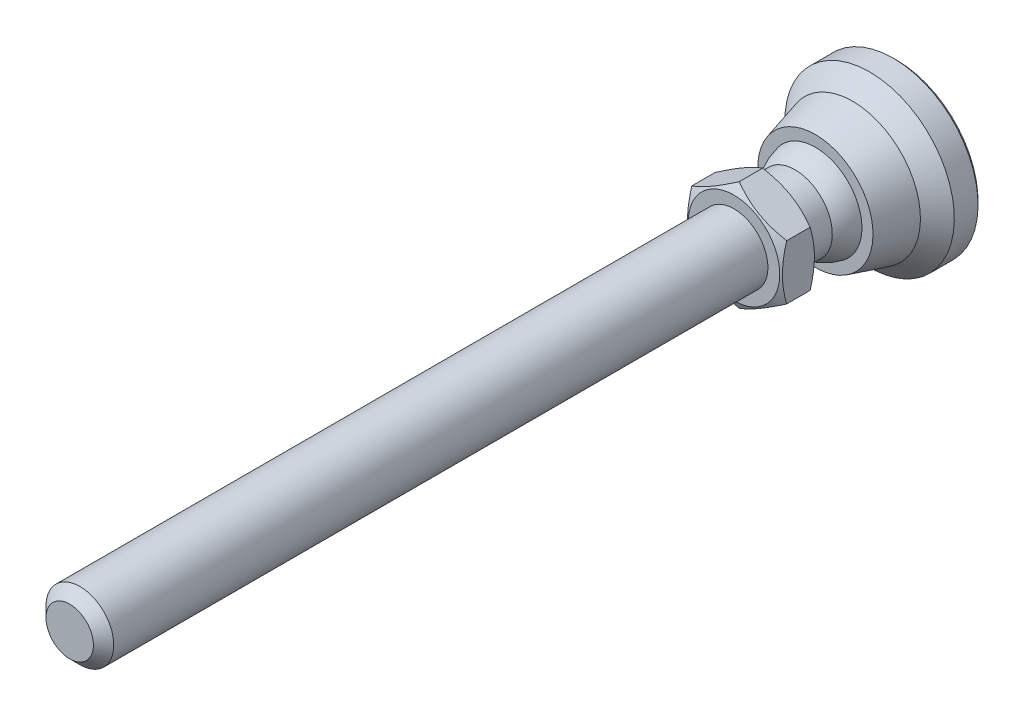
ISO-10303-21;
HEADER;
FILE_DESCRIPTION(('STEP AP214'),'2;1');
FILE_NAME('part.step','',(''),(''),'','','');
FILE_SCHEMA(('AUTOMOTIVE_DESIGN { 1 0 10303 214 1 1 1 1 }'));
ENDSEC;
DATA;
#1=APPLICATION_CONTEXT('core data for automotive mechanical design processes');
#2=APPLICATION_PROTOCOL_DEFINITION('international standard','automotive_design',2000,#1);
#3=PRODUCT_CONTEXT('',#1,'mechanical');
#4=PRODUCT('Part','Part','',(#3));
#5=PRODUCT_RELATED_PRODUCT_CATEGORY('part','',(#4));
#6=PRODUCT_DEFINITION_FORMATION('','',#4);
#7=PRODUCT_DEFINITION_CONTEXT('part definition',#1,'design');
#8=PRODUCT_DEFINITION('design','',#6,#7);
#9=PRODUCT_DEFINITION_SHAPE('','',#8);
#10=(LENGTH_UNIT() NAMED_UNIT(*) SI_UNIT(.MILLI.,.METRE.));
#11=(NAMED_UNIT(*) PLANE_ANGLE_UNIT() SI_UNIT($,.RADIAN.));
#12=(NAMED_UNIT(*) SI_UNIT($,.STERADIAN.) SOLID_ANGLE_UNIT());
#13=UNCERTAINTY_MEASURE_WITH_UNIT(LENGTH_MEASURE(1.E-05),#10,'distance_accuracy_value','');
#14=(GEOMETRIC_REPRESENTATION_CONTEXT(3) GLOBAL_UNCERTAINTY_ASSIGNED_CONTEXT((#13)) GLOBAL_UNIT_ASSIGNED_CONTEXT((#10,
#11,#12)) REPRESENTATION_CONTEXT('',''));
#15=CARTESIAN_POINT('',(0.,0.,0.));
#16=DIRECTION('',(0.,0.,1.));
#17=DIRECTION('',(1.,0.,0.));
#18=AXIS2_PLACEMENT_3D('',#15,#16,#17);
#19=CARTESIAN_POINT('',(-5.49999999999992,0.,19.));
#20=DIRECTION('',(0.,0.,1.));
#21=DIRECTION('',(0.,-1.,0.));
#22=AXIS2_PLACEMENT_3D('',#19,#20,#21);
#23=PLANE('',#22);
#24=CARTESIAN_POINT('',(0.,0.,19.));
#25=DIRECTION('',(0.,0.,-1.));
#26=DIRECTION('',(0.,1.,0.));
#27=AXIS2_PLACEMENT_3D('',#24,#25,#26);
#28=CIRCLE('',#27,5.49999999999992);
#29=CARTESIAN_POINT('',(0.,5.49999999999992,19.));
#30=VERTEX_POINT('',#29);
#31=EDGE_CURVE('E115',#30,#30,#28,.T.);
#32=ORIENTED_EDGE('',*,*,#31,.F.);
#33=EDGE_LOOP('',(#32));
#34=FACE_BOUND('',#33,.T.);
#35=CARTESIAN_POINT('',(0.,0.,19.));
#36=DIRECTION('',(0.,0.,-1.));
#37=DIRECTION('',(0.,1.,0.));
#38=AXIS2_PLACEMENT_3D('',#35,#36,#37);
#39=CIRCLE('',#38,6.75);
#40=CARTESIAN_POINT('',(0.,6.75,19.));
#41=VERTEX_POINT('',#40);
#42=EDGE_CURVE('E73',#41,#41,#39,.T.);
#43=ORIENTED_EDGE('',*,*,#42,.T.);
#44=EDGE_LOOP('',(#43));
#45=FACE_BOUND('',#44,.T.);
#46=ADVANCED_FACE('F14',(#34,#45),#23,.F.);
#47=CARTESIAN_POINT('',(0.,0.,0.));
#48=DIRECTION('',(0.,0.,-1.));
#49=DIRECTION('',(0.,1.,0.));
#50=AXIS2_PLACEMENT_3D('',#47,#48,#49);
#51=CYLINDRICAL_SURFACE('',#50,5.49999999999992);
#52=CARTESIAN_POINT('',(0.,0.,15.));
#53=DIRECTION('',(0.,0.,-1.));
#54=DIRECTION('',(0.,1.,0.));
#55=AXIS2_PLACEMENT_3D('',#52,#53,#54);
#56=CIRCLE('',#55,5.49999999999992);
#57=CARTESIAN_POINT('',(-5.49999999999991,0.,15.));
#58=VERTEX_POINT('',#57);
#59=EDGE_CURVE('E112',#58,#58,#56,.T.);
#60=ORIENTED_EDGE('',*,*,#59,.F.);
#61=EDGE_LOOP('',(#60));
#62=FACE_BOUND('',#61,.T.);
#63=ORIENTED_EDGE('',*,*,#31,.T.);
#64=EDGE_LOOP('',(#63));
#65=FACE_BOUND('',#64,.T.);
#66=ADVANCED_FACE('F139',(#62,#65),#51,.T.);
#67=CARTESIAN_POINT('',(0.,0.,10.6698729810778));
#68=DIRECTION('',(0.,0.,-1.));
#69=DIRECTION('',(-1.,0.,0.));
#70=AXIS2_PLACEMENT_3D('',#67,#68,#69);
#71=SPHERICAL_SURFACE('',#70,7.);
#72=CARTESIAN_POINT('',(0.,0.,12.));
#73=DIRECTION('',(0.,0.,-1.));
#74=DIRECTION('',(0.,1.,0.));
#75=AXIS2_PLACEMENT_3D('',#72,#73,#74);
#76=CIRCLE('',#75,6.87246404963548);
#77=CARTESIAN_POINT('',(-6.87246404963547,0.,12.));
#78=VERTEX_POINT('',#77);
#79=EDGE_CURVE('E109',#78,#78,#76,.T.);
#80=CARTESIAN_POINT('',(-6.87246404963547,0.,12.));
#81=CARTESIAN_POINT('',(-6.8658721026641,0.,12.0340591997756));
#82=CARTESIAN_POINT('',(-6.85902692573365,0.,12.0680693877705));
#83=CARTESIAN_POINT('',(-6.84483171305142,0.,12.1359842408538));
#84=CARTESIAN_POINT('',(-6.83748167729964,0.,12.1698889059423));
#85=CARTESIAN_POINT('',(-6.82227834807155,0.,12.2375852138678));
#86=CARTESIAN_POINT('',(-6.81442505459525,0.,12.2713768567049));
#87=CARTESIAN_POINT('',(-6.79821695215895,0.,12.3388396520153));
#88=CARTESIAN_POINT('',(-6.78986214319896,0.,12.3725108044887));
#89=CARTESIAN_POINT('',(-6.7726528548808,0.,12.4397251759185));
#90=CARTESIAN_POINT('',(-6.76379837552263,0.,12.473268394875));
#91=CARTESIAN_POINT('',(-6.74559170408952,0.,12.5402194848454));
#92=CARTESIAN_POINT('',(-6.73623951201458,0.,12.5736273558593));
#93=CARTESIAN_POINT('',(-6.71703948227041,0.,12.6403003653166));
#94=CARTESIAN_POINT('',(-6.70719164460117,0.,12.67356550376));
#95=CARTESIAN_POINT('',(-6.68700250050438,0.,12.7399456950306));
#96=CARTESIAN_POINT('',(-6.67666119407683,0.,12.7730607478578));
#97=CARTESIAN_POINT('',(-6.65548739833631,0.,12.8391334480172));
#98=CARTESIAN_POINT('',(-6.64465490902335,0.,12.8720910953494));
#99=CARTESIAN_POINT('',(-6.6225011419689,0.,12.9378416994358));
#100=CARTESIAN_POINT('',(-6.61117986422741,0.,12.9706346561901));
#101=CARTESIAN_POINT('',(-6.5880510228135,0.,13.0360486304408));
#102=CARTESIAN_POINT('',(-6.57624345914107,0.,13.0686696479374));
#103=CARTESIAN_POINT('',(-6.55214465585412,0.,13.1337325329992));
#104=CARTESIAN_POINT('',(-6.5398534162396,0.,13.1661744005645));
#105=CARTESIAN_POINT('',(-6.51478997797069,0.,13.2308718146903));
#106=CARTESIAN_POINT('',(-6.5020177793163,0.,13.2631273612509));
#107=CARTESIAN_POINT('',(-6.47599524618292,0.,13.3274450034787));
#108=CARTESIAN_POINT('',(-6.46274491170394,0.,13.3595070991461));
#109=CARTESIAN_POINT('',(-6.4357690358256,0.,13.4234307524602));
#110=CARTESIAN_POINT('',(-6.42204349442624,0.,13.455292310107));
#111=CARTESIAN_POINT('',(-6.39412023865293,0.,13.5188078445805));
#112=CARTESIAN_POINT('',(-6.37992252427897,0.,13.5504618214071));
#113=CARTESIAN_POINT('',(-6.35105806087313,0.,13.6135551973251));
#114=CARTESIAN_POINT('',(-6.33639131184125,0.,13.6449945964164));
#115=CARTESIAN_POINT('',(-6.30659202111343,0.,13.7076518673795));
#116=CARTESIAN_POINT('',(-6.29145947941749,0.,13.7388697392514));
#117=CARTESIAN_POINT('',(-6.26073194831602,0.,13.8010770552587));
#118=CARTESIAN_POINT('',(-6.24513695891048,0.,13.8320664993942));
#119=CARTESIAN_POINT('',(-6.21348797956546,0.,13.8938101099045));
#120=CARTESIAN_POINT('',(-6.19743398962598,0.,13.9245642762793));
#121=CARTESIAN_POINT('',(-6.16487055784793,0.,13.9858305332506));
#122=CARTESIAN_POINT('',(-6.14836111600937,0.,14.016342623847));
#123=CARTESIAN_POINT('',(-6.11489042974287,0.,14.0771179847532));
#124=CARTESIAN_POINT('',(-6.09792918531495,0.,14.107381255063));
#125=CARTESIAN_POINT('',(-6.06355864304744,0.,14.1676522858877));
#126=CARTESIAN_POINT('',(-6.04614934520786,0.,14.1976600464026));
#127=CARTESIAN_POINT('',(-6.01088654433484,0.,14.2574134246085));
#128=CARTESIAN_POINT('',(-5.99303304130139,0.,14.2871590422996));
#129=CARTESIAN_POINT('',(-5.9568857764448,0.,14.3463815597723));
#130=CARTESIAN_POINT('',(-5.93859201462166,0.,14.3758584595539));
#131=CARTESIAN_POINT('',(-5.90156827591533,0.,14.4345370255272));
#132=CARTESIAN_POINT('',(-5.88283829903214,0.,14.4637386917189));
#133=CARTESIAN_POINT('',(-5.84494627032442,0.,14.5218603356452));
#134=CARTESIAN_POINT('',(-5.82578421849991,0.,14.5507803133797));
#135=CARTESIAN_POINT('',(-5.78703227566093,0.,14.6083321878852));
#136=CARTESIAN_POINT('',(-5.76744238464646,0.,14.6369640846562));
#137=CARTESIAN_POINT('',(-5.72783909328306,0.,14.6939334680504));
#138=CARTESIAN_POINT('',(-5.70782569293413,0.,14.7222709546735));
#139=CARTESIAN_POINT('',(-5.66737980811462,0.,14.778645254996));
#140=CARTESIAN_POINT('',(-5.64694732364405,0.,14.8066820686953));
#141=CARTESIAN_POINT('',(-5.60566778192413,0.,14.862448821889));
#142=CARTESIAN_POINT('',(-5.58482072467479,0.,14.8901787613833));
#143=CARTESIAN_POINT('',(-5.54271666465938,0.,14.9453256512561));
#144=CARTESIAN_POINT('',(-5.52145966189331,0.,14.9727426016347));
#145=CARTESIAN_POINT('',(-5.49999999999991,0.,15.));
#146=B_SPLINE_CURVE_WITH_KNOTS('',3,(#80,#81,#82,#83,#84,#85,#86,#87,#88,#89,#90,#91,#92,#93,
#94,#95,#96,#97,#98,#99,#100,#101,#102,#103,#104,#105,#106,#107,#108,#109,#110,#111,#112,#113,
#114,#115,#116,#117,#118,#119,#120,#121,#122,#123,#124,#125,#126,#127,#128,#129,#130,#131,#132,
#133,#134,#135,#136,#137,#138,#139,#140,#141,#142,#143,#144,#145),.UNSPECIFIED.,.F.,.F.,(4,2,2,
2,2,2,2,2,2,2,2,2,2,2,2,2,2,2,2,2,2,2,2,2,2,2,2,2,2,2,2,2,4),(0.,0.104072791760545,
0.208145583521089,0.312218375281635,0.416291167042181,0.520363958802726,0.62443675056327,
0.728509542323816,0.83258233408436,0.936655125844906,1.04072791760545,1.144800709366,
1.24887350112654,1.35294629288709,1.45701908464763,1.56109187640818,1.66516466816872,
1.76923745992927,1.87331025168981,1.97738304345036,2.0814558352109,2.18552862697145,
2.28960141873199,2.39367421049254,2.49774700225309,2.60181979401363,2.70589258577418,
2.80996537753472,2.91403816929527,3.01811096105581,3.12218375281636,3.2262565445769,
3.33032933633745),.UNSPECIFIED.);
#147=EDGE_CURVE('BSEAM146',#78,#58,#146,.T.);
#148=ORIENTED_EDGE('',*,*,#79,.F.);
#149=ORIENTED_EDGE('',*,*,#59,.T.);
#150=ORIENTED_EDGE('',*,*,#147,.T.);
#151=ORIENTED_EDGE('',*,*,#147,.F.);
#152=EDGE_LOOP('',(#148,#150,#149,#151));
#153=FACE_BOUND('',#152,.T.);
#154=ADVANCED_FACE('F146',(#153),#71,.T.);
#155=CARTESIAN_POINT('',(-8.5,0.,12.));
#156=DIRECTION('',(0.,0.,-1.));
#157=DIRECTION('',(0.,1.,0.));
#158=AXIS2_PLACEMENT_3D('',#155,#156,#157);
#159=PLANE('',#158);
#160=CARTESIAN_POINT('',(0.,0.,12.));
#161=DIRECTION('',(0.,0.,-1.));
#162=DIRECTION('',(0.,1.,0.));
#163=AXIS2_PLACEMENT_3D('',#160,#161,#162);
#164=CIRCLE('',#163,8.5);
#165=CARTESIAN_POINT('',(0.,8.5,12.));
#166=VERTEX_POINT('',#165);
#167=EDGE_CURVE('E106',#166,#166,#164,.T.);
#168=ORIENTED_EDGE('',*,*,#167,.F.);
#169=EDGE_LOOP('',(#168));
#170=FACE_BOUND('',#169,.T.);
#171=ORIENTED_EDGE('',*,*,#79,.T.);
#172=EDGE_LOOP('',(#171));
#173=FACE_BOUND('',#172,.T.);
#174=ADVANCED_FACE('F250',(#170,#173),#159,.F.);
#175=CARTESIAN_POINT('',(0.,0.,12.));
#176=DIRECTION('',(0.,0.,-1.));
#177=DIRECTION('',(0.,1.,0.));
#178=AXIS2_PLACEMENT_3D('',#175,#176,#177);
#179=CONICAL_SURFACE('',#178,8.5,0.266252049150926);
#180=CARTESIAN_POINT('',(0.,0.,6.5));
#181=DIRECTION('',(0.,0.,-1.));
#182=DIRECTION('',(0.,1.,0.));
#183=AXIS2_PLACEMENT_3D('',#180,#181,#182);
#184=CIRCLE('',#183,10.);
#185=CARTESIAN_POINT('',(0.,10.,6.5));
#186=VERTEX_POINT('',#185);
#187=EDGE_CURVE('E103',#186,#186,#184,.T.);
#188=ORIENTED_EDGE('',*,*,#187,.F.);
#189=EDGE_LOOP('',(#188));
#190=FACE_BOUND('',#189,.T.);
#191=ORIENTED_EDGE('',*,*,#167,.T.);
#192=EDGE_LOOP('',(#191));
#193=FACE_BOUND('',#192,.T.);
#194=ADVANCED_FACE('F246',(#190,#193),#179,.T.);
#195=CARTESIAN_POINT('',(0.,0.,6.5));
#196=DIRECTION('',(0.,0.,-1.));
#197=DIRECTION('',(0.,1.,0.));
#198=AXIS2_PLACEMENT_3D('',#195,#196,#197);
#199=CONICAL_SURFACE('',#198,10.,0.785398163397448);
#200=CARTESIAN_POINT('',(0.,0.,4.));
#201=DIRECTION('',(0.,0.,-1.));
#202=DIRECTION('',(0.,1.,0.));
#203=AXIS2_PLACEMENT_3D('',#200,#201,#202);
#204=CIRCLE('',#203,12.5);
#205=CARTESIAN_POINT('',(0.,12.5,4.));
#206=VERTEX_POINT('',#205);
#207=EDGE_CURVE('E100',#206,#206,#204,.T.);
#208=ORIENTED_EDGE('',*,*,#207,.F.);
#209=EDGE_LOOP('',(#208));
#210=FACE_BOUND('',#209,.T.);
#211=ORIENTED_EDGE('',*,*,#187,.T.);
#212=EDGE_LOOP('',(#211));
#213=FACE_BOUND('',#212,.T.);
#214=ADVANCED_FACE('F242',(#210,#213),#199,.T.);
#215=CARTESIAN_POINT('',(0.,0.,0.));
#216=DIRECTION('',(0.,0.,-1.));
#217=DIRECTION('',(0.,1.,0.));
#218=AXIS2_PLACEMENT_3D('',#215,#216,#217);
#219=CYLINDRICAL_SURFACE('',#218,12.5);
#220=CARTESIAN_POINT('',(0.,0.,0.499999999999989));
#221=DIRECTION('',(0.,0.,-1.));
#222=DIRECTION('',(0.,1.,0.));
#223=AXIS2_PLACEMENT_3D('',#220,#221,#222);
#224=CIRCLE('',#223,12.5);
#225=CARTESIAN_POINT('',(0.,12.5,0.499999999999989));
#226=VERTEX_POINT('',#225);
#227=EDGE_CURVE('E97',#226,#226,#224,.T.);
#228=ORIENTED_EDGE('',*,*,#227,.F.);
#229=EDGE_LOOP('',(#228));
#230=FACE_BOUND('',#229,.T.);
#231=ORIENTED_EDGE('',*,*,#207,.T.);
#232=EDGE_LOOP('',(#231));
#233=FACE_BOUND('',#232,.T.);
#234=ADVANCED_FACE('F238',(#230,#233),#219,.T.);
#235=CARTESIAN_POINT('',(0.,0.,0.499999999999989));
#236=DIRECTION('',(0.,0.,1.));
#237=DIRECTION('',(0.,-1.,0.));
#238=AXIS2_PLACEMENT_3D('',#235,#236,#237);
#239=CONICAL_SURFACE('',#238,12.5,0.785398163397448);
#240=CARTESIAN_POINT('',(0.,0.,0.));
#241=DIRECTION('',(0.,0.,-1.));
#242=DIRECTION('',(0.,1.,0.));
#243=AXIS2_PLACEMENT_3D('',#240,#241,#242);
#244=CIRCLE('',#243,12.);
#245=CARTESIAN_POINT('',(0.,12.,0.));
#246=VERTEX_POINT('',#245);
#247=EDGE_CURVE('E94',#246,#246,#244,.T.);
#248=ORIENTED_EDGE('',*,*,#247,.F.);
#249=EDGE_LOOP('',(#248));
#250=FACE_BOUND('',#249,.T.);
#251=ORIENTED_EDGE('',*,*,#227,.T.);
#252=EDGE_LOOP('',(#251));
#253=FACE_BOUND('',#252,.T.);
#254=ADVANCED_FACE('F234',(#250,#253),#239,.T.);
#255=CARTESIAN_POINT('',(-12.,0.,0.));
#256=DIRECTION('',(0.,0.,1.));
#257=DIRECTION('',(0.,-1.,0.));
#258=AXIS2_PLACEMENT_3D('',#255,#256,#257);
#259=PLANE('',#258);
#260=ORIENTED_EDGE('',*,*,#247,.T.);
#261=EDGE_LOOP('',(#260));
#262=FACE_BOUND('',#261,.T.);
#263=ADVANCED_FACE('F136',(#262),#259,.F.);
#264=CARTESIAN_POINT('',(0.,0.,19.));
#265=DIRECTION('',(0.,0.,1.));
#266=DIRECTION('',(0.,-1.,0.));
#267=AXIS2_PLACEMENT_3D('',#264,#265,#266);
#268=CONICAL_SURFACE('',#267,6.75,1.0471975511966);
#269=CARTESIAN_POINT('',(-7.,10.8183826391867,22.5423615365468));
#270=CARTESIAN_POINT('',(-7.,10.5129575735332,22.3943539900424));
#271=CARTESIAN_POINT('',(-7.,10.2068273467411,22.2477764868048));
#272=CARTESIAN_POINT('',(-7.,9.59278140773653,21.9582866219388));
#273=CARTESIAN_POINT('',(-7.,9.28486541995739,21.8153748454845));
#274=CARTESIAN_POINT('',(-7.,8.66526829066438,21.5332944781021));
#275=CARTESIAN_POINT('',(-7.,8.35357575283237,21.3941508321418));
#276=CARTESIAN_POINT('',(-7.,7.72769846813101,21.1216080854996));
#277=CARTESIAN_POINT('',(-7.,7.41351384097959,20.988208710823));
#278=CARTESIAN_POINT('',(-7.,6.77215896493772,20.7245643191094));
#279=CARTESIAN_POINT('',(-7.,6.44489230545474,20.5945525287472));
#280=CARTESIAN_POINT('',(-7.,5.78651717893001,20.3444596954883));
#281=CARTESIAN_POINT('',(-7.,5.45540828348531,20.2243797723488));
#282=CARTESIAN_POINT('',(-7.,4.78944983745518,19.9973308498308));
#283=CARTESIAN_POINT('',(-7.,4.45460954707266,19.8903349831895));
#284=CARTESIAN_POINT('',(-7.,3.78013830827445,19.6929106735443));
#285=CARTESIAN_POINT('',(-7.,3.44050891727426,19.6024769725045));
#286=CARTESIAN_POINT('',(-7.,2.75808654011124,19.4430262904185));
#287=CARTESIAN_POINT('',(-7.,2.41532108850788,19.3738946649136));
#288=CARTESIAN_POINT('',(-7.,1.89808177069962,19.2891856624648));
#289=CARTESIAN_POINT('',(-7.,1.72514049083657,19.264112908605));
#290=CARTESIAN_POINT('',(-7.,1.3784111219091,19.2207895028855));
#291=CARTESIAN_POINT('',(-7.,1.20462311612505,19.202538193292));
#292=CARTESIAN_POINT('',(-7.,0.858686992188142,19.1734482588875));
#293=CARTESIAN_POINT('',(-7.,0.686546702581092,19.1625168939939));
#294=CARTESIAN_POINT('',(-7.,0.34195829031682,19.1479408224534));
#295=CARTESIAN_POINT('',(-7.,0.169510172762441,19.1442959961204));
#296=CARTESIAN_POINT('',(-7.,-0.175386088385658,19.1443798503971));
#297=CARTESIAN_POINT('',(-7.,-0.347834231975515,19.1481085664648));
#298=CARTESIAN_POINT('',(-7.,-0.692421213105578,19.1628490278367));
#299=CARTESIAN_POINT('',(-7.,-0.864560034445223,19.1738611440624));
#300=CARTESIAN_POINT('',(-7.,-1.27940337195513,19.2089443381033));
#301=CARTESIAN_POINT('',(-7.,-1.52181643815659,19.2365344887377));
#302=CARTESIAN_POINT('',(-7.,-2.00480728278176,19.304644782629));
#303=CARTESIAN_POINT('',(-7.,-2.24538480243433,19.3451667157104));
#304=CARTESIAN_POINT('',(-7.,-2.96410921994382,19.4839783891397));
#305=CARTESIAN_POINT('',(-7.,-3.43897238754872,19.5994876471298));
#306=CARTESIAN_POINT('',(-7.,-4.1489718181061,19.7993375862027));
#307=CARTESIAN_POINT('',(-7.,-4.38780216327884,19.87130534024));
#308=CARTESIAN_POINT('',(-7.,-4.86314237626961,20.0226026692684));
#309=CARTESIAN_POINT('',(-7.,-5.09965222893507,20.1019322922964));
#310=CARTESIAN_POINT('',(-7.,-5.57042805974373,20.266689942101));
#311=CARTESIAN_POINT('',(-7.,-5.80469477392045,20.3521158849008));
#312=CARTESIAN_POINT('',(-7.,-6.27129484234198,20.5280723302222));
#313=CARTESIAN_POINT('',(-7.,-6.50362821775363,20.6186027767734));
#314=CARTESIAN_POINT('',(-7.,-7.04586925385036,20.8356586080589));
#315=CARTESIAN_POINT('',(-7.,-7.35509172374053,20.9638923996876));
#316=CARTESIAN_POINT('',(-7.,-7.97095986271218,21.2264225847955));
#317=CARTESIAN_POINT('',(-7.,-8.27760538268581,21.3607193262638));
#318=CARTESIAN_POINT('',(-7.,-8.88878567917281,21.6341747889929));
#319=CARTESIAN_POINT('',(-7.,-9.19332003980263,21.7733344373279));
#320=CARTESIAN_POINT('',(-7.,-9.80057813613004,22.0555565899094));
#321=CARTESIAN_POINT('',(-7.,-10.1033018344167,22.198619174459));
#322=CARTESIAN_POINT('',(-7.,-10.7075355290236,22.48807011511));
#323=CARTESIAN_POINT('',(-7.,-11.0090439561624,22.6344617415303));
#324=CARTESIAN_POINT('',(-7.,-11.6107732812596,22.9298700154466));
#325=CARTESIAN_POINT('',(-7.,-11.9109941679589,23.0788866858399));
#326=CARTESIAN_POINT('',(-7.,-12.8099532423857,23.5291468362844));
#327=CARTESIAN_POINT('',(-7.,-13.40706480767,23.8336376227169));
#328=CARTESIAN_POINT('',(-7.,-14.5491749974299,24.4234568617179));
#329=CARTESIAN_POINT('',(-7.,-15.0944235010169,24.7083035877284));
#330=CARTESIAN_POINT('',(-7.,-16.1828898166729,25.2818920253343));
#331=CARTESIAN_POINT('',(-7.,-16.7261075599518,25.5706338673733));
#332=CARTESIAN_POINT('',(-7.,-17.8096482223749,26.1503912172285));
#333=CARTESIAN_POINT('',(-7.,-18.349974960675,26.4413995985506));
#334=CARTESIAN_POINT('',(-7.,-19.4293265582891,27.0257533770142));
#335=CARTESIAN_POINT('',(-7.,-19.9683514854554,27.3190986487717));
#336=CARTESIAN_POINT('',(-7.,-20.5068955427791,27.6133181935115));
#337=B_SPLINE_CURVE_WITH_KNOTS('',3,(#269,#270,#271,#272,#273,#274,#275,#276,#277,#278,#279,
#280,#281,#282,#283,#284,#285,#286,#287,#288,#289,#290,#291,#292,#293,#294,#295,#296,#297,#298,
#299,#300,#301,#302,#303,#304,#305,#306,#307,#308,#309,#310,#311,#312,#313,#314,#315,#316,#317,
#318,#319,#320,#321,#322,#323,#324,#325,#326,#327,#328,#329,#330,#331,#332,#333,#334,#335,#336),
.UNSPECIFIED.,.F.,.F.,(4,2,2,2,2,2,2,2,2,2,2,2,2,2,2,2,2,2,2,2,2,2,2,2,2,2,2,2,2,2,2,2,2,4),(0.,
1.01820529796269,2.03657213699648,3.06054657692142,4.0844721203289,5.14078390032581,
6.19721461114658,7.25143822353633,8.30532656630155,9.35343977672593,9.87757439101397,
10.4016584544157,10.9189702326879,11.4362735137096,11.9535792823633,12.4709113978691,
13.2024315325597,13.9340529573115,15.3981226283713,16.1463755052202,16.8946332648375,
17.642636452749,18.3906314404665,19.3948167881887,20.3990598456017,21.4034954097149,
22.40795165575,23.4134413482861,24.4189398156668,26.429680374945,28.2751722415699,
30.1207260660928,31.9618472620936,33.8028703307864),.UNSPECIFIED.);
#338=CARTESIAN_POINT('',(-7.,4.04145188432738,19.7695523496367));
#339=VERTEX_POINT('',#338);
#340=CARTESIAN_POINT('',(-7.,-4.04145188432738,19.7695523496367));
#341=VERTEX_POINT('',#340);
#342=EDGE_CURVE('E79',#339,#341,#337,.T.);
#343=ORIENTED_EDGE('',*,*,#342,.F.);
#344=CARTESIAN_POINT('',(0.000199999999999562,8.0830192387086,19.7696190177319));
#345=CARTESIAN_POINT('',(-0.153667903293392,7.99418356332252,19.7183374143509));
#346=CARTESIAN_POINT('',(-0.308109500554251,7.90501666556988,19.669383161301));
#347=CARTESIAN_POINT('',(-0.618246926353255,7.72595873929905,19.5767703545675));
#348=CARTESIAN_POINT('',(-0.773943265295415,7.63606741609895,19.5331140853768));
#349=CARTESIAN_POINT('',(-1.24352516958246,7.36495417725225,19.4109491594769));
#350=CARTESIAN_POINT('',(-1.5592643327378,7.18266208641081,19.3414631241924));
#351=CARTESIAN_POINT('',(-2.03176224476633,6.9098652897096,19.2599825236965));
#352=CARTESIAN_POINT('',(-2.18710922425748,6.82017566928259,19.2367710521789));
#353=CARTESIAN_POINT('',(-2.49850511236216,6.64039116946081,19.1978487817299));
#354=CARTESIAN_POINT('',(-2.65455395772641,6.55029632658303,19.1821373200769));
#355=CARTESIAN_POINT('',(-2.96692267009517,6.36995016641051,19.1586154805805));
#356=CARTESIAN_POINT('',(-3.12324202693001,6.27969914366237,19.1507961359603));
#357=CARTESIAN_POINT('',(-3.43601650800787,6.09911871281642,19.1432178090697));
#358=CARTESIAN_POINT('',(-3.59247162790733,6.00878930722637,19.1434585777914));
#359=CARTESIAN_POINT('',(-4.02110687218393,5.76131663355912,19.155197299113));
#360=CARTESIAN_POINT('',(-4.2931466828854,5.60425437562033,19.1749033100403));
#361=CARTESIAN_POINT('',(-4.83541944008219,5.29117305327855,19.2373910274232));
#362=CARTESIAN_POINT('',(-5.10565047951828,5.13515508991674,19.2801940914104));
#363=CARTESIAN_POINT('',(-5.64901454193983,4.82144370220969,19.3871892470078));
#364=CARTESIAN_POINT('',(-5.92207900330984,4.66378986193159,19.4518346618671));
#365=CARTESIAN_POINT('',(-6.46413578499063,4.35083323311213,19.5985536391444));
#366=CARTESIAN_POINT('',(-6.73313504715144,4.19552643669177,19.680592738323));
#367=CARTESIAN_POINT('',(-7.0002,4.04133641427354,19.7696190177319));
#368=B_SPLINE_CURVE_WITH_KNOTS('',3,(#344,#345,#346,#347,#348,#349,#350,#351,#352,#353,#354,
#355,#356,#357,#358,#359,#360,#361,#362,#363,#364,#365,#366,#367),.UNSPECIFIED.,.F.,.F.,(4,2,2,
2,2,2,2,2,2,2,2,4),(0.,0.554727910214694,1.10969417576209,2.2219327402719,2.76443041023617,
3.30688013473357,3.84871284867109,4.39052882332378,5.33376515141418,6.27787517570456,
7.2429241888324,8.20607866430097),.UNSPECIFIED.);
#369=CARTESIAN_POINT('',(0.,8.08290376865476,19.7695523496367));
#370=VERTEX_POINT('',#369);
#371=EDGE_CURVE('E406',#370,#339,#368,.T.);
#372=ORIENTED_EDGE('',*,*,#371,.F.);
#373=CARTESIAN_POINT('',(7.0002,4.04133641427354,19.7696190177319));
#374=CARTESIAN_POINT('',(6.84633209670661,4.13017208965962,19.7183374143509));
#375=CARTESIAN_POINT('',(6.69189049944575,4.21933898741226,19.669383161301));
#376=CARTESIAN_POINT('',(6.38175307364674,4.39839691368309,19.5767703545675));
#377=CARTESIAN_POINT('',(6.22605673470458,4.48828823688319,19.5331140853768));
#378=CARTESIAN_POINT('',(5.75647483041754,4.75940147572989,19.4109491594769));
#379=CARTESIAN_POINT('',(5.4407356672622,4.94169356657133,19.3414631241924));
#380=CARTESIAN_POINT('',(4.96823775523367,5.21449036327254,19.2599825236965));
#381=CARTESIAN_POINT('',(4.81289077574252,5.30417998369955,19.2367710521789));
#382=CARTESIAN_POINT('',(4.50149488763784,5.48396448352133,19.1978487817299));
#383=CARTESIAN_POINT('',(4.3454460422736,5.57405932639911,19.1821373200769));
#384=CARTESIAN_POINT('',(4.03307732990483,5.75440548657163,19.1586154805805));
#385=CARTESIAN_POINT('',(3.87675797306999,5.84465650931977,19.1507961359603));
#386=CARTESIAN_POINT('',(3.56398349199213,6.02523694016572,19.1432178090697));
#387=CARTESIAN_POINT('',(3.40752837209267,6.11556634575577,19.1434585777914));
#388=CARTESIAN_POINT('',(2.97889312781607,6.36303901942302,19.155197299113));
#389=CARTESIAN_POINT('',(2.7068533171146,6.52010127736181,19.1749033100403));
#390=CARTESIAN_POINT('',(2.16458055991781,6.83318259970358,19.2373910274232));
#391=CARTESIAN_POINT('',(1.89434952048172,6.9892005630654,19.2801940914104));
#392=CARTESIAN_POINT('',(1.35098545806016,7.30291195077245,19.3871892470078));
#393=CARTESIAN_POINT('',(1.07792099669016,7.46056579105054,19.4518346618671));
#394=CARTESIAN_POINT('',(0.535864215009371,7.77352241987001,19.5985536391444));
#395=CARTESIAN_POINT('',(0.26686495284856,7.92882921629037,19.680592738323));
#396=CARTESIAN_POINT('',(-0.000200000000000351,8.0830192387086,19.7696190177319));
#397=B_SPLINE_CURVE_WITH_KNOTS('',3,(#373,#374,#375,#376,#377,#378,#379,#380,#381,#382,#383,
#384,#385,#386,#387,#388,#389,#390,#391,#392,#393,#394,#395,#396),.UNSPECIFIED.,.F.,.F.,(4,2,2,
2,2,2,2,2,2,2,2,4),(0.,0.554727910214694,1.10969417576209,2.2219327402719,2.76443041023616,
3.30688013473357,3.84871284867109,4.39052882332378,5.33376515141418,6.27787517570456,
7.2429241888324,8.20607866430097),.UNSPECIFIED.);
#398=CARTESIAN_POINT('',(7.,4.04145188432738,19.7695523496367));
#399=VERTEX_POINT('',#398);
#400=EDGE_CURVE('E394',#399,#370,#397,.T.);
#401=ORIENTED_EDGE('',*,*,#400,.F.);
#402=CARTESIAN_POINT('',(7.,10.8183826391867,22.5423615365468));
#403=CARTESIAN_POINT('',(7.,10.5129575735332,22.3943539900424));
#404=CARTESIAN_POINT('',(7.,10.2068273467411,22.2477764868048));
#405=CARTESIAN_POINT('',(7.,9.59278140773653,21.9582866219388));
#406=CARTESIAN_POINT('',(7.,9.28486541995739,21.8153748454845));
#407=CARTESIAN_POINT('',(7.,8.66526829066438,21.5332944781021));
#408=CARTESIAN_POINT('',(7.,8.35357575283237,21.3941508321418));
#409=CARTESIAN_POINT('',(7.,7.72769846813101,21.1216080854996));
#410=CARTESIAN_POINT('',(7.,7.4135138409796,20.988208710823));
#411=CARTESIAN_POINT('',(7.,6.77215896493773,20.7245643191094));
#412=CARTESIAN_POINT('',(7.,6.44489230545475,20.5945525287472));
#413=CARTESIAN_POINT('',(7.,5.78651717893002,20.3444596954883));
#414=CARTESIAN_POINT('',(7.,5.45540828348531,20.2243797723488));
#415=CARTESIAN_POINT('',(7.,4.78944983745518,19.9973308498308));
#416=CARTESIAN_POINT('',(7.,4.45460954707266,19.8903349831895));
#417=CARTESIAN_POINT('',(7.,3.78013830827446,19.6929106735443));
#418=CARTESIAN_POINT('',(7.,3.44050891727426,19.6024769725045));
#419=CARTESIAN_POINT('',(7.,2.75808654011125,19.4430262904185));
#420=CARTESIAN_POINT('',(7.,2.41532108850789,19.3738946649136));
#421=CARTESIAN_POINT('',(7.,1.89808177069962,19.2891856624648));
#422=CARTESIAN_POINT('',(7.,1.72514049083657,19.264112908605));
#423=CARTESIAN_POINT('',(7.,1.3784111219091,19.2207895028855));
#424=CARTESIAN_POINT('',(7.,1.20462311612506,19.202538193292));
#425=CARTESIAN_POINT('',(7.,0.858686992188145,19.1734482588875));
#426=CARTESIAN_POINT('',(7.,0.686546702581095,19.1625168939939));
#427=CARTESIAN_POINT('',(7.,0.341958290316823,19.1479408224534));
#428=CARTESIAN_POINT('',(7.,0.169510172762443,19.1442959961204));
#429=CARTESIAN_POINT('',(7.,-0.175386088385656,19.1443798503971));
#430=CARTESIAN_POINT('',(7.,-0.347834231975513,19.1481085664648));
#431=CARTESIAN_POINT('',(7.,-0.692421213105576,19.1628490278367));
#432=CARTESIAN_POINT('',(7.,-0.86456003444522,19.1738611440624));
#433=CARTESIAN_POINT('',(7.,-1.27940337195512,19.2089443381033));
#434=CARTESIAN_POINT('',(7.,-1.52181643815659,19.2365344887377));
#435=CARTESIAN_POINT('',(7.,-2.00480728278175,19.304644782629));
#436=CARTESIAN_POINT('',(7.,-2.24538480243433,19.3451667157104));
#437=CARTESIAN_POINT('',(7.,-2.96410921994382,19.4839783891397));
#438=CARTESIAN_POINT('',(7.,-3.43897238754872,19.5994876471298));
#439=CARTESIAN_POINT('',(7.,-4.14897181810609,19.7993375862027));
#440=CARTESIAN_POINT('',(7.,-4.38780216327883,19.87130534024));
#441=CARTESIAN_POINT('',(7.,-4.86314237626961,20.0226026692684));
#442=CARTESIAN_POINT('',(7.,-5.09965222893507,20.1019322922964));
#443=CARTESIAN_POINT('',(7.,-5.57042805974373,20.266689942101));
#444=CARTESIAN_POINT('',(7.,-5.80469477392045,20.3521158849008));
#445=CARTESIAN_POINT('',(7.,-6.27129484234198,20.5280723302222));
#446=CARTESIAN_POINT('',(7.,-6.50362821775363,20.6186027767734));
#447=CARTESIAN_POINT('',(7.,-7.04586925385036,20.8356586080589));
#448=CARTESIAN_POINT('',(7.,-7.35509172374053,20.9638923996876));
#449=CARTESIAN_POINT('',(7.,-7.97095986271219,21.2264225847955));
#450=CARTESIAN_POINT('',(7.,-8.27760538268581,21.3607193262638));
#451=CARTESIAN_POINT('',(7.,-8.88878567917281,21.6341747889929));
#452=CARTESIAN_POINT('',(7.,-9.19332003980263,21.7733344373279));
#453=CARTESIAN_POINT('',(7.,-9.80057813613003,22.0555565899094));
#454=CARTESIAN_POINT('',(7.,-10.1033018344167,22.198619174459));
#455=CARTESIAN_POINT('',(7.,-10.7075355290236,22.48807011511));
#456=CARTESIAN_POINT('',(7.,-11.0090439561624,22.6344617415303));
#457=CARTESIAN_POINT('',(7.,-11.6107732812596,22.9298700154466));
#458=CARTESIAN_POINT('',(7.,-11.9109941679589,23.0788866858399));
#459=CARTESIAN_POINT('',(7.,-12.8099532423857,23.5291468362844));
#460=CARTESIAN_POINT('',(7.,-13.40706480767,23.8336376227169));
#461=CARTESIAN_POINT('',(7.,-14.5491749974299,24.4234568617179));
#462=CARTESIAN_POINT('',(7.,-15.0944235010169,24.7083035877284));
#463=CARTESIAN_POINT('',(7.,-16.1828898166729,25.2818920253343));
#464=CARTESIAN_POINT('',(7.,-16.7261075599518,25.5706338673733));
#465=CARTESIAN_POINT('',(7.,-17.8096482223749,26.1503912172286));
#466=CARTESIAN_POINT('',(7.,-18.349974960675,26.4413995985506));
#467=CARTESIAN_POINT('',(7.,-19.4293265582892,27.0257533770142));
#468=CARTESIAN_POINT('',(7.,-19.9683514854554,27.3190986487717));
#469=CARTESIAN_POINT('',(7.,-20.5068955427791,27.6133181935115));
#470=B_SPLINE_CURVE_WITH_KNOTS('',3,(#402,#403,#404,#405,#406,#407,#408,#409,#410,#411,#412,
#413,#414,#415,#416,#417,#418,#419,#420,#421,#422,#423,#424,#425,#426,#427,#428,#429,#430,#431,
#432,#433,#434,#435,#436,#437,#438,#439,#440,#441,#442,#443,#444,#445,#446,#447,#448,#449,#450,
#451,#452,#453,#454,#455,#456,#457,#458,#459,#460,#461,#462,#463,#464,#465,#466,#467,#468,#469),
.UNSPECIFIED.,.F.,.F.,(4,2,2,2,2,2,2,2,2,2,2,2,2,2,2,2,2,2,2,2,2,2,2,2,2,2,2,2,2,2,2,2,2,4),(0.,
1.01820529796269,2.03657213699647,3.06054657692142,4.08447212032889,5.14078390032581,
6.19721461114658,7.25143822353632,8.30532656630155,9.35343977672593,9.87757439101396,
10.4016584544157,10.9189702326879,11.4362735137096,11.9535792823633,12.4709113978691,
13.2024315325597,13.9340529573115,15.3981226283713,16.1463755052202,16.8946332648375,
17.642636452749,18.3906314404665,19.3948167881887,20.3990598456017,21.4034954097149,
22.40795165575,23.4134413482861,24.4189398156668,26.429680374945,28.2751722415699,
30.1207260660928,31.9618472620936,33.8028703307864),.UNSPECIFIED.);
#471=CARTESIAN_POINT('',(7.,-4.04145188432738,19.7695523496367));
#472=VERTEX_POINT('',#471);
#473=EDGE_CURVE('E29',#472,#399,#470,.F.);
#474=ORIENTED_EDGE('',*,*,#473,.F.);
#475=CARTESIAN_POINT('',(-0.00019999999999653,-8.08301923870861,19.7696190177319));
#476=CARTESIAN_POINT('',(0.153667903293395,-7.99418356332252,19.7183374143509));
#477=CARTESIAN_POINT('',(0.308109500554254,-7.90501666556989,19.669383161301));
#478=CARTESIAN_POINT('',(0.618246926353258,-7.72595873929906,19.5767703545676));
#479=CARTESIAN_POINT('',(0.773943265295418,-7.63606741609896,19.5331140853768));
#480=CARTESIAN_POINT('',(1.24352516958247,-7.36495417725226,19.4109491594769));
#481=CARTESIAN_POINT('',(1.5592643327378,-7.18266208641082,19.3414631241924));
#482=CARTESIAN_POINT('',(2.03176224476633,-6.90986528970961,19.2599825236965));
#483=CARTESIAN_POINT('',(2.18710922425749,-6.8201756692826,19.2367710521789));
#484=CARTESIAN_POINT('',(2.49850511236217,-6.64039116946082,19.1978487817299));
#485=CARTESIAN_POINT('',(2.65455395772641,-6.55029632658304,19.1821373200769));
#486=CARTESIAN_POINT('',(2.96692267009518,-6.36995016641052,19.1586154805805));
#487=CARTESIAN_POINT('',(3.12324202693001,-6.27969914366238,19.1507961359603));
#488=CARTESIAN_POINT('',(3.43601650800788,-6.09911871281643,19.1432178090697));
#489=CARTESIAN_POINT('',(3.59247162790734,-6.00878930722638,19.1434585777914));
#490=CARTESIAN_POINT('',(4.02110687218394,-5.76131663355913,19.155197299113));
#491=CARTESIAN_POINT('',(4.2931466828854,-5.60425437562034,19.1749033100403));
#492=CARTESIAN_POINT('',(4.83541944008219,-5.29117305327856,19.2373910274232));
#493=CARTESIAN_POINT('',(5.10565047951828,-5.13515508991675,19.2801940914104));
#494=CARTESIAN_POINT('',(5.64901454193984,-4.8214437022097,19.3871892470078));
#495=CARTESIAN_POINT('',(5.92207900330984,-4.66378986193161,19.4518346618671));
#496=CARTESIAN_POINT('',(6.46413578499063,-4.35083323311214,19.5985536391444));
#497=CARTESIAN_POINT('',(6.73313504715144,-4.19552643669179,19.680592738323));
#498=CARTESIAN_POINT('',(7.0002,-4.04133641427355,19.7696190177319));
#499=B_SPLINE_CURVE_WITH_KNOTS('',3,(#475,#476,#477,#478,#479,#480,#481,#482,#483,#484,#485,
#486,#487,#488,#489,#490,#491,#492,#493,#494,#495,#496,#497,#498),.UNSPECIFIED.,.F.,.F.,(4,2,2,
2,2,2,2,2,2,2,2,4),(0.,0.554727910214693,1.10969417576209,2.2219327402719,2.76443041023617,
3.30688013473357,3.84871284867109,4.39052882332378,5.33376515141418,6.27787517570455,
7.24292418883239,8.20607866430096),.UNSPECIFIED.);
#500=CARTESIAN_POINT('',(0.,-8.08290376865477,19.7695523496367));
#501=VERTEX_POINT('',#500);
#502=EDGE_CURVE('E66',#501,#472,#499,.T.);
#503=ORIENTED_EDGE('',*,*,#502,.F.);
#504=CARTESIAN_POINT('',(-7.0002,-4.04133641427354,19.7696190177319));
#505=CARTESIAN_POINT('',(-6.84633209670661,-4.13017208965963,19.7183374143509));
#506=CARTESIAN_POINT('',(-6.69189049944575,-4.21933898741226,19.669383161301));
#507=CARTESIAN_POINT('',(-6.38175307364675,-4.3983969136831,19.5767703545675));
#508=CARTESIAN_POINT('',(-6.22605673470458,-4.48828823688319,19.5331140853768));
#509=CARTESIAN_POINT('',(-5.75647483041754,-4.7594014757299,19.4109491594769));
#510=CARTESIAN_POINT('',(-5.4407356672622,-4.94169356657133,19.3414631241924));
#511=CARTESIAN_POINT('',(-4.96823775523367,-5.21449036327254,19.2599825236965));
#512=CARTESIAN_POINT('',(-4.81289077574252,-5.30417998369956,19.2367710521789));
#513=CARTESIAN_POINT('',(-4.50149488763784,-5.48396448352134,19.1978487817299));
#514=CARTESIAN_POINT('',(-4.34544604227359,-5.57405932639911,19.1821373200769));
#515=CARTESIAN_POINT('',(-4.03307732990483,-5.75440548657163,19.1586154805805));
#516=CARTESIAN_POINT('',(-3.87675797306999,-5.84465650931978,19.1507961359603));
#517=CARTESIAN_POINT('',(-3.56398349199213,-6.02523694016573,19.1432178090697));
#518=CARTESIAN_POINT('',(-3.40752837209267,-6.11556634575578,19.1434585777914));
#519=CARTESIAN_POINT('',(-2.97889312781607,-6.36303901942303,19.155197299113));
#520=CARTESIAN_POINT('',(-2.7068533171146,-6.52010127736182,19.1749033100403));
#521=CARTESIAN_POINT('',(-2.1645805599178,-6.83318259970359,19.2373910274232));
#522=CARTESIAN_POINT('',(-1.89434952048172,-6.9892005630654,19.2801940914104));
#523=CARTESIAN_POINT('',(-1.35098545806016,-7.30291195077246,19.3871892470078));
#524=CARTESIAN_POINT('',(-1.07792099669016,-7.46056579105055,19.4518346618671));
#525=CARTESIAN_POINT('',(-0.535864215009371,-7.77352241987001,19.5985536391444));
#526=CARTESIAN_POINT('',(-0.26686495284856,-7.92882921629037,19.680592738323));
#527=CARTESIAN_POINT('',(0.000200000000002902,-8.0830192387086,19.7696190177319));
#528=B_SPLINE_CURVE_WITH_KNOTS('',3,(#504,#505,#506,#507,#508,#509,#510,#511,#512,#513,#514,
#515,#516,#517,#518,#519,#520,#521,#522,#523,#524,#525,#526,#527),.UNSPECIFIED.,.F.,.F.,(4,2,2,
2,2,2,2,2,2,2,2,4),(0.,0.554727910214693,1.10969417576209,2.2219327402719,2.76443041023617,
3.30688013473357,3.84871284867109,4.39052882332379,5.33376515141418,6.27787517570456,
7.2429241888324,8.20607866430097),.UNSPECIFIED.);
#529=EDGE_CURVE('E69',#341,#501,#528,.T.);
#530=ORIENTED_EDGE('',*,*,#529,.F.);
#531=EDGE_LOOP('',(#343,#372,#401,#474,#503,#530));
#532=FACE_BOUND('',#531,.T.);
#533=ORIENTED_EDGE('',*,*,#42,.F.);
#534=EDGE_LOOP('',(#533));
#535=FACE_BOUND('',#534,.T.);
#536=ADVANCED_FACE('F67',(#532,#535),#268,.T.);
#537=CARTESIAN_POINT('',(-3.49999999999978,0.,122.));
#538=DIRECTION('',(0.,0.,-1.));
#539=DIRECTION('',(0.,1.,0.));
#540=AXIS2_PLACEMENT_3D('',#537,#538,#539);
#541=PLANE('',#540);
#542=CARTESIAN_POINT('',(0.,0.,122.));
#543=DIRECTION('',(0.,0.,-1.));
#544=DIRECTION('',(0.,1.,0.));
#545=AXIS2_PLACEMENT_3D('',#542,#543,#544);
#546=CIRCLE('',#545,3.49999999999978);
#547=CARTESIAN_POINT('',(0.,3.49999999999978,122.));
#548=VERTEX_POINT('',#547);
#549=EDGE_CURVE('E9',#548,#548,#546,.T.);
#550=ORIENTED_EDGE('',*,*,#549,.F.);
#551=EDGE_LOOP('',(#550));
#552=FACE_BOUND('',#551,.T.);
#553=ADVANCED_FACE('F16',(#552),#541,.F.);
#554=CARTESIAN_POINT('',(0.,0.,122.));
#555=DIRECTION('',(0.,0.,-1.));
#556=DIRECTION('',(0.,1.,0.));
#557=AXIS2_PLACEMENT_3D('',#554,#555,#556);
#558=CONICAL_SURFACE('',#557,3.49999999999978,0.785398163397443);
#559=CARTESIAN_POINT('',(0.,0.,120.5));
#560=DIRECTION('',(0.,0.,-1.));
#561=DIRECTION('',(0.,1.,0.));
#562=AXIS2_PLACEMENT_3D('',#559,#560,#561);
#563=CIRCLE('',#562,4.99999999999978);
#564=CARTESIAN_POINT('',(0.,4.99999999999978,120.5));
#565=VERTEX_POINT('',#564);
#566=EDGE_CURVE('E22',#565,#565,#563,.T.);
#567=ORIENTED_EDGE('',*,*,#566,.F.);
#568=EDGE_LOOP('',(#567));
#569=FACE_BOUND('',#568,.T.);
#570=ORIENTED_EDGE('',*,*,#549,.T.);
#571=EDGE_LOOP('',(#570));
#572=FACE_BOUND('',#571,.T.);
#573=ADVANCED_FACE('F125',(#569,#572),#558,.T.);
#574=CARTESIAN_POINT('',(0.,0.,0.));
#575=DIRECTION('',(0.,0.,-1.));
#576=DIRECTION('',(0.,1.,0.));
#577=AXIS2_PLACEMENT_3D('',#574,#575,#576);
#578=CYLINDRICAL_SURFACE('',#577,4.99999999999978);
#579=CARTESIAN_POINT('',(0.,0.,24.));
#580=DIRECTION('',(0.,0.,-1.));
#581=DIRECTION('',(0.,1.,0.));
#582=AXIS2_PLACEMENT_3D('',#579,#580,#581);
#583=CIRCLE('',#582,4.99999999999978);
#584=CARTESIAN_POINT('',(0.,4.99999999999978,24.));
#585=VERTEX_POINT('',#584);
#586=EDGE_CURVE('E118',#585,#585,#583,.T.);
#587=ORIENTED_EDGE('',*,*,#586,.F.);
#588=EDGE_LOOP('',(#587));
#589=FACE_BOUND('',#588,.T.);
#590=ORIENTED_EDGE('',*,*,#566,.T.);
#591=EDGE_LOOP('',(#590));
#592=FACE_BOUND('',#591,.T.);
#593=ADVANCED_FACE('F123',(#589,#592),#578,.T.);
#594=CARTESIAN_POINT('',(-4.99999999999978,0.,24.));
#595=DIRECTION('',(0.,0.,-1.));
#596=DIRECTION('',(0.,1.,0.));
#597=AXIS2_PLACEMENT_3D('',#594,#595,#596);
#598=PLANE('',#597);
#599=ORIENTED_EDGE('',*,*,#586,.T.);
#600=EDGE_LOOP('',(#599));
#601=FACE_BOUND('',#600,.T.);
#602=CARTESIAN_POINT('',(0.,0.,24.));
#603=DIRECTION('',(0.,0.,-1.));
#604=DIRECTION('',(0.,1.,0.));
#605=AXIS2_PLACEMENT_3D('',#602,#603,#604);
#606=CIRCLE('',#605,6.75);
#607=CARTESIAN_POINT('',(0.,6.75,24.));
#608=VERTEX_POINT('',#607);
#609=EDGE_CURVE('E78',#608,#608,#606,.T.);
#610=ORIENTED_EDGE('',*,*,#609,.F.);
#611=EDGE_LOOP('',(#610));
#612=FACE_BOUND('',#611,.T.);
#613=ADVANCED_FACE('F153',(#601,#612),#598,.F.);
#614=CARTESIAN_POINT('',(0.,0.,22.3684844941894));
#615=DIRECTION('',(0.,0.,-1.));
#616=DIRECTION('',(0.,1.,0.));
#617=AXIS2_PLACEMENT_3D('',#614,#615,#616);
#618=CONICAL_SURFACE('',#617,9.57586774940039,1.0471975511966);
#619=CARTESIAN_POINT('',(7.0002,-4.04133641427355,23.2303809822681));
#620=CARTESIAN_POINT('',(6.84633209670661,-4.13017208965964,23.2816625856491));
#621=CARTESIAN_POINT('',(6.69189049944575,-4.21933898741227,23.330616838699));
#622=CARTESIAN_POINT('',(6.38175307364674,-4.3983969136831,23.4232296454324));
#623=CARTESIAN_POINT('',(6.22605673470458,-4.4882882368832,23.4668859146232));
#624=CARTESIAN_POINT('',(5.75647483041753,-4.7594014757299,23.5890508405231));
#625=CARTESIAN_POINT('',(5.4407356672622,-4.94169356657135,23.6585368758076));
#626=CARTESIAN_POINT('',(4.96823775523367,-5.21449036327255,23.7400174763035));
#627=CARTESIAN_POINT('',(4.81289077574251,-5.30417998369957,23.7632289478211));
#628=CARTESIAN_POINT('',(4.50149488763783,-5.48396448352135,23.8021512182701));
#629=CARTESIAN_POINT('',(4.34544604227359,-5.57405932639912,23.8178626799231));
#630=CARTESIAN_POINT('',(4.03307732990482,-5.75440548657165,23.8413845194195));
#631=CARTESIAN_POINT('',(3.87675797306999,-5.84465650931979,23.8492038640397));
#632=CARTESIAN_POINT('',(3.56398349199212,-6.02523694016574,23.8567821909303));
#633=CARTESIAN_POINT('',(3.40752837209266,-6.11556634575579,23.8565414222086));
#634=CARTESIAN_POINT('',(2.97889312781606,-6.36303901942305,23.844802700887));
#635=CARTESIAN_POINT('',(2.7068533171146,-6.52010127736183,23.8250966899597));
#636=CARTESIAN_POINT('',(2.1645805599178,-6.8331825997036,23.7626089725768));
#637=CARTESIAN_POINT('',(1.89434952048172,-6.98920056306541,23.7198059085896));
#638=CARTESIAN_POINT('',(1.35098545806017,-7.30291195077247,23.6128107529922));
#639=CARTESIAN_POINT('',(1.07792099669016,-7.46056579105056,23.5481653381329));
#640=CARTESIAN_POINT('',(0.535864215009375,-7.77352241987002,23.4014463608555));
#641=CARTESIAN_POINT('',(0.266864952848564,-7.92882921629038,23.319407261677));
#642=CARTESIAN_POINT('',(-0.000199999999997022,-8.08301923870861,23.2303809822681));
#643=B_SPLINE_CURVE_WITH_KNOTS('',3,(#619,#620,#621,#622,#623,#624,#625,#626,#627,#628,#629,
#630,#631,#632,#633,#634,#635,#636,#637,#638,#639,#640,#641,#642),.UNSPECIFIED.,.F.,.F.,(4,2,2,
2,2,2,2,2,2,2,2,4),(0.,0.554727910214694,1.10969417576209,2.2219327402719,2.76443041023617,
3.30688013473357,3.8487128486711,4.39052882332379,5.33376515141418,6.27787517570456,
7.24292418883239,8.20607866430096),.UNSPECIFIED.);
#644=CARTESIAN_POINT('',(7.,-4.04145188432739,23.2304476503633));
#645=VERTEX_POINT('',#644);
#646=CARTESIAN_POINT('',(0.,-8.08290376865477,23.2304476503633));
#647=VERTEX_POINT('',#646);
#648=EDGE_CURVE('E84',#645,#647,#643,.T.);
#649=ORIENTED_EDGE('',*,*,#648,.F.);
#650=CARTESIAN_POINT('',(7.,10.8183826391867,20.4576384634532));
#651=CARTESIAN_POINT('',(7.,10.5129575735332,20.6056460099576));
#652=CARTESIAN_POINT('',(7.,10.2068273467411,20.7522235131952));
#653=CARTESIAN_POINT('',(7.,9.59278140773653,21.0417133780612));
#654=CARTESIAN_POINT('',(7.,9.28486541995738,21.1846251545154));
#655=CARTESIAN_POINT('',(7.,8.66526829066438,21.4667055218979));
#656=CARTESIAN_POINT('',(7.,8.35357575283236,21.6058491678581));
#657=CARTESIAN_POINT('',(7.,7.727698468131,21.8783919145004));
#658=CARTESIAN_POINT('',(7.,7.41351384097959,22.011791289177));
#659=CARTESIAN_POINT('',(7.,6.77215896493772,22.2754356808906));
#660=CARTESIAN_POINT('',(7.,6.44489230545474,22.4054474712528));
#661=CARTESIAN_POINT('',(7.,5.78651717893,22.6555403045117));
#662=CARTESIAN_POINT('',(7.,5.4554082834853,22.7756202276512));
#663=CARTESIAN_POINT('',(7.,4.78944983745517,23.0026691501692));
#664=CARTESIAN_POINT('',(7.,4.45460954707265,23.1096650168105));
#665=CARTESIAN_POINT('',(7.,3.78013830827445,23.3070893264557));
#666=CARTESIAN_POINT('',(7.,3.44050891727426,23.3975230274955));
#667=CARTESIAN_POINT('',(7.,2.75808654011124,23.5569737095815));
#668=CARTESIAN_POINT('',(7.,2.41532108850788,23.6261053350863));
#669=CARTESIAN_POINT('',(7.,1.89808177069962,23.7108143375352));
#670=CARTESIAN_POINT('',(7.,1.72514049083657,23.735887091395));
#671=CARTESIAN_POINT('',(7.,1.3784111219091,23.7792104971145));
#672=CARTESIAN_POINT('',(7.,1.20462311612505,23.7974618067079));
#673=CARTESIAN_POINT('',(7.,0.858686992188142,23.8265517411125));
#674=CARTESIAN_POINT('',(7.,0.686546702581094,23.8374831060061));
#675=CARTESIAN_POINT('',(7.,0.341958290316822,23.8520591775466));
#676=CARTESIAN_POINT('',(7.,0.169510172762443,23.8557040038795));
#677=CARTESIAN_POINT('',(7.,-0.175386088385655,23.8556201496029));
#678=CARTESIAN_POINT('',(7.,-0.347834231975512,23.8518914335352));
#679=CARTESIAN_POINT('',(7.,-0.692421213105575,23.8371509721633));
#680=CARTESIAN_POINT('',(7.,-0.86456003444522,23.8261388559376));
#681=CARTESIAN_POINT('',(7.,-1.27940337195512,23.7910556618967));
#682=CARTESIAN_POINT('',(7.,-1.52181643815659,23.7634655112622));
#683=CARTESIAN_POINT('',(7.,-2.00480728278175,23.695355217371));
#684=CARTESIAN_POINT('',(7.,-2.24538480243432,23.6548332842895));
#685=CARTESIAN_POINT('',(7.,-2.96410921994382,23.5160216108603));
#686=CARTESIAN_POINT('',(7.,-3.43897238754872,23.4005123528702));
#687=CARTESIAN_POINT('',(7.,-4.1489718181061,23.2006624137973));
#688=CARTESIAN_POINT('',(7.,-4.38780216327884,23.12869465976));
#689=CARTESIAN_POINT('',(7.,-4.86314237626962,22.9773973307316));
#690=CARTESIAN_POINT('',(7.,-5.09965222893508,22.8980677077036));
#691=CARTESIAN_POINT('',(7.,-5.57042805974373,22.733310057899));
#692=CARTESIAN_POINT('',(7.,-5.80469477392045,22.6478841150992));
#693=CARTESIAN_POINT('',(7.,-6.27129484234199,22.4719276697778));
#694=CARTESIAN_POINT('',(7.,-6.50362821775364,22.3813972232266));
#695=CARTESIAN_POINT('',(7.,-7.04586925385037,22.1643413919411));
#696=CARTESIAN_POINT('',(7.,-7.35509172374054,22.0361076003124));
#697=CARTESIAN_POINT('',(7.,-7.97095986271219,21.7735774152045));
#698=CARTESIAN_POINT('',(7.,-8.27760538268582,21.6392806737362));
#699=CARTESIAN_POINT('',(7.,-8.88878567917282,21.3658252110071));
#700=CARTESIAN_POINT('',(7.,-9.19332003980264,21.2266655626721));
#701=CARTESIAN_POINT('',(7.,-9.80057813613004,20.9444434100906));
#702=CARTESIAN_POINT('',(7.,-10.1033018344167,20.8013808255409));
#703=CARTESIAN_POINT('',(7.,-10.7075355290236,20.51192988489));
#704=CARTESIAN_POINT('',(7.,-11.0090439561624,20.3655382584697));
#705=CARTESIAN_POINT('',(7.,-11.6107732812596,20.0701299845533));
#706=CARTESIAN_POINT('',(7.,-11.9109941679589,19.9211133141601));
#707=CARTESIAN_POINT('',(7.,-12.8099532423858,19.4708531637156));
#708=CARTESIAN_POINT('',(7.,-13.4070648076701,19.1663623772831));
#709=CARTESIAN_POINT('',(7.,-14.5491749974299,18.5765431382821));
#710=CARTESIAN_POINT('',(7.,-15.0944235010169,18.2916964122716));
#711=CARTESIAN_POINT('',(7.,-16.1828898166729,17.7181079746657));
#712=CARTESIAN_POINT('',(7.,-16.7261075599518,17.4293661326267));
#713=CARTESIAN_POINT('',(7.,-17.809648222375,16.8496087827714));
#714=CARTESIAN_POINT('',(7.,-18.349974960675,16.5586004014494));
#715=CARTESIAN_POINT('',(7.,-19.4293265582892,15.9742466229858));
#716=CARTESIAN_POINT('',(7.,-19.9683514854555,15.6809013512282));
#717=CARTESIAN_POINT('',(7.,-20.5068955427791,15.3866818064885));
#718=B_SPLINE_CURVE_WITH_KNOTS('',3,(#650,#651,#652,#653,#654,#655,#656,#657,#658,#659,#660,
#661,#662,#663,#664,#665,#666,#667,#668,#669,#670,#671,#672,#673,#674,#675,#676,#677,#678,#679,
#680,#681,#682,#683,#684,#685,#686,#687,#688,#689,#690,#691,#692,#693,#694,#695,#696,#697,#698,
#699,#700,#701,#702,#703,#704,#705,#706,#707,#708,#709,#710,#711,#712,#713,#714,#715,#716,#717),
.UNSPECIFIED.,.F.,.F.,(4,2,2,2,2,2,2,2,2,2,2,2,2,2,2,2,2,2,2,2,2,2,2,2,2,2,2,2,2,2,2,2,2,4),(0.,
1.0182052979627,2.03657213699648,3.06054657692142,4.0844721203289,5.14078390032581,
6.19721461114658,7.25143822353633,8.30532656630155,9.35343977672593,9.87757439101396,
10.4016584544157,10.9189702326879,11.4362735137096,11.9535792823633,12.4709113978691,
13.2024315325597,13.9340529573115,15.3981226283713,16.1463755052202,16.8946332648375,
17.642636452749,18.3906314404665,19.3948167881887,20.3990598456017,21.4034954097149,
22.40795165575,23.4134413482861,24.4189398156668,26.4296803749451,28.2751722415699,
30.1207260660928,31.9618472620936,33.8028703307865),.UNSPECIFIED.);
#719=CARTESIAN_POINT('',(7.,4.04145188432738,23.2304476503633));
#720=VERTEX_POINT('',#719);
#721=EDGE_CURVE('E169',#720,#645,#718,.T.);
#722=ORIENTED_EDGE('',*,*,#721,.F.);
#723=CARTESIAN_POINT('',(-0.000200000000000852,8.0830192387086,23.2303809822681));
#724=CARTESIAN_POINT('',(0.153667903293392,7.99418356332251,23.2816625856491));
#725=CARTESIAN_POINT('',(0.30810950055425,7.90501666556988,23.330616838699));
#726=CARTESIAN_POINT('',(0.618246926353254,7.72595873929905,23.4232296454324));
#727=CARTESIAN_POINT('',(0.773943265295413,7.63606741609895,23.4668859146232));
#728=CARTESIAN_POINT('',(1.24352516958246,7.36495417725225,23.5890508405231));
#729=CARTESIAN_POINT('',(1.5592643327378,7.18266208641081,23.6585368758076));
#730=CARTESIAN_POINT('',(2.03176224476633,6.9098652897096,23.7400174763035));
#731=CARTESIAN_POINT('',(2.18710922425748,6.82017566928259,23.7632289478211));
#732=CARTESIAN_POINT('',(2.49850511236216,6.64039116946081,23.8021512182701));
#733=CARTESIAN_POINT('',(2.6545539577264,6.55029632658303,23.8178626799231));
#734=CARTESIAN_POINT('',(2.96692267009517,6.36995016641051,23.8413845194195));
#735=CARTESIAN_POINT('',(3.12324202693,6.27969914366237,23.8492038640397));
#736=CARTESIAN_POINT('',(3.43601650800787,6.09911871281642,23.8567821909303));
#737=CARTESIAN_POINT('',(3.59247162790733,6.00878930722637,23.8565414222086));
#738=CARTESIAN_POINT('',(4.02110687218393,5.76131663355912,23.844802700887));
#739=CARTESIAN_POINT('',(4.29314668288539,5.60425437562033,23.8250966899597));
#740=CARTESIAN_POINT('',(4.83541944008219,5.29117305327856,23.7626089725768));
#741=CARTESIAN_POINT('',(5.10565047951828,5.13515508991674,23.7198059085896));
#742=CARTESIAN_POINT('',(5.64901454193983,4.82144370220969,23.6128107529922));
#743=CARTESIAN_POINT('',(5.92207900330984,4.66378986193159,23.5481653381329));
#744=CARTESIAN_POINT('',(6.46413578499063,4.35083323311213,23.4014463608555));
#745=CARTESIAN_POINT('',(6.73313504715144,4.19552643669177,23.319407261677));
#746=CARTESIAN_POINT('',(7.0002,4.04133641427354,23.2303809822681));
#747=B_SPLINE_CURVE_WITH_KNOTS('',3,(#723,#724,#725,#726,#727,#728,#729,#730,#731,#732,#733,
#734,#735,#736,#737,#738,#739,#740,#741,#742,#743,#744,#745,#746),.UNSPECIFIED.,.F.,.F.,(4,2,2,
2,2,2,2,2,2,2,2,4),(0.,0.554727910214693,1.10969417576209,2.2219327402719,2.76443041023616,
3.30688013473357,3.84871284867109,4.39052882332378,5.33376515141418,6.27787517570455,
7.24292418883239,8.20607866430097),.UNSPECIFIED.);
#748=CARTESIAN_POINT('',(0.,8.08290376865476,23.2304476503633));
#749=VERTEX_POINT('',#748);
#750=EDGE_CURVE('E204',#749,#720,#747,.T.);
#751=ORIENTED_EDGE('',*,*,#750,.F.);
#752=CARTESIAN_POINT('',(-7.0002,4.04133641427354,23.2303809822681));
#753=CARTESIAN_POINT('',(-6.84633209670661,4.13017208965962,23.2816625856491));
#754=CARTESIAN_POINT('',(-6.69189049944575,4.21933898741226,23.330616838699));
#755=CARTESIAN_POINT('',(-6.38175307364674,4.39839691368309,23.4232296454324));
#756=CARTESIAN_POINT('',(-6.22605673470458,4.48828823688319,23.4668859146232));
#757=CARTESIAN_POINT('',(-5.75647483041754,4.75940147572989,23.5890508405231));
#758=CARTESIAN_POINT('',(-5.4407356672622,4.94169356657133,23.6585368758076));
#759=CARTESIAN_POINT('',(-4.96823775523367,5.21449036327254,23.7400174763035));
#760=CARTESIAN_POINT('',(-4.81289077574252,5.30417998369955,23.7632289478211));
#761=CARTESIAN_POINT('',(-4.50149488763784,5.48396448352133,23.8021512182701));
#762=CARTESIAN_POINT('',(-4.3454460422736,5.57405932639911,23.8178626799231));
#763=CARTESIAN_POINT('',(-4.03307732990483,5.75440548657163,23.8413845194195));
#764=CARTESIAN_POINT('',(-3.87675797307,5.84465650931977,23.8492038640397));
#765=CARTESIAN_POINT('',(-3.56398349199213,6.02523694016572,23.8567821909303));
#766=CARTESIAN_POINT('',(-3.40752837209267,6.11556634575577,23.8565414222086));
#767=CARTESIAN_POINT('',(-2.97889312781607,6.36303901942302,23.844802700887));
#768=CARTESIAN_POINT('',(-2.70685331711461,6.52010127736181,23.8250966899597));
#769=CARTESIAN_POINT('',(-2.16458055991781,6.83318259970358,23.7626089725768));
#770=CARTESIAN_POINT('',(-1.89434952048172,6.9892005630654,23.7198059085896));
#771=CARTESIAN_POINT('',(-1.35098545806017,7.30291195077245,23.6128107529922));
#772=CARTESIAN_POINT('',(-1.07792099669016,7.46056579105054,23.5481653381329));
#773=CARTESIAN_POINT('',(-0.535864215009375,7.77352241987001,23.4014463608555));
#774=CARTESIAN_POINT('',(-0.266864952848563,7.92882921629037,23.319407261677));
#775=CARTESIAN_POINT('',(0.000199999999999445,8.0830192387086,23.2303809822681));
#776=B_SPLINE_CURVE_WITH_KNOTS('',3,(#752,#753,#754,#755,#756,#757,#758,#759,#760,#761,#762,
#763,#764,#765,#766,#767,#768,#769,#770,#771,#772,#773,#774,#775),.UNSPECIFIED.,.F.,.F.,(4,2,2,
2,2,2,2,2,2,2,2,4),(0.,0.554727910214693,1.10969417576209,2.22193274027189,2.76443041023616,
3.30688013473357,3.84871284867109,4.39052882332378,5.33376515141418,6.27787517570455,
7.24292418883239,8.20607866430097),.UNSPECIFIED.);
#777=CARTESIAN_POINT('',(-7.,4.04145188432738,23.2304476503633));
#778=VERTEX_POINT('',#777);
#779=EDGE_CURVE('E211',#778,#749,#776,.T.);
#780=ORIENTED_EDGE('',*,*,#779,.F.);
#781=CARTESIAN_POINT('',(-7.,10.8183826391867,20.4576384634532));
#782=CARTESIAN_POINT('',(-7.,10.5129575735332,20.6056460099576));
#783=CARTESIAN_POINT('',(-7.,10.2068273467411,20.7522235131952));
#784=CARTESIAN_POINT('',(-7.,9.59278140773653,21.0417133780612));
#785=CARTESIAN_POINT('',(-7.,9.28486541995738,21.1846251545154));
#786=CARTESIAN_POINT('',(-7.,8.66526829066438,21.4667055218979));
#787=CARTESIAN_POINT('',(-7.,8.35357575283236,21.6058491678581));
#788=CARTESIAN_POINT('',(-7.,7.727698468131,21.8783919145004));
#789=CARTESIAN_POINT('',(-7.,7.41351384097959,22.011791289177));
#790=CARTESIAN_POINT('',(-7.,6.77215896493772,22.2754356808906));
#791=CARTESIAN_POINT('',(-7.,6.44489230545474,22.4054474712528));
#792=CARTESIAN_POINT('',(-7.,5.78651717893,22.6555403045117));
#793=CARTESIAN_POINT('',(-7.,5.4554082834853,22.7756202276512));
#794=CARTESIAN_POINT('',(-7.,4.78944983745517,23.0026691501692));
#795=CARTESIAN_POINT('',(-7.,4.45460954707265,23.1096650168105));
#796=CARTESIAN_POINT('',(-7.,3.78013830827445,23.3070893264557));
#797=CARTESIAN_POINT('',(-7.,3.44050891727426,23.3975230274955));
#798=CARTESIAN_POINT('',(-7.,2.75808654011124,23.5569737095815));
#799=CARTESIAN_POINT('',(-7.,2.41532108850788,23.6261053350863));
#800=CARTESIAN_POINT('',(-7.,1.89808177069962,23.7108143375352));
#801=CARTESIAN_POINT('',(-7.,1.72514049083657,23.735887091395));
#802=CARTESIAN_POINT('',(-7.,1.3784111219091,23.7792104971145));
#803=CARTESIAN_POINT('',(-7.,1.20462311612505,23.7974618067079));
#804=CARTESIAN_POINT('',(-7.,0.858686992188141,23.8265517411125));
#805=CARTESIAN_POINT('',(-7.,0.686546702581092,23.8374831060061));
#806=CARTESIAN_POINT('',(-7.,0.341958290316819,23.8520591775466));
#807=CARTESIAN_POINT('',(-7.,0.16951017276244,23.8557040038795));
#808=CARTESIAN_POINT('',(-7.,-0.175386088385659,23.8556201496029));
#809=CARTESIAN_POINT('',(-7.,-0.347834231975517,23.8518914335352));
#810=CARTESIAN_POINT('',(-7.,-0.692421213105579,23.8371509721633));
#811=CARTESIAN_POINT('',(-7.,-0.864560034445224,23.8261388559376));
#812=CARTESIAN_POINT('',(-7.,-1.27940337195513,23.7910556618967));
#813=CARTESIAN_POINT('',(-7.,-1.52181643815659,23.7634655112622));
#814=CARTESIAN_POINT('',(-7.,-2.00480728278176,23.695355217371));
#815=CARTESIAN_POINT('',(-7.,-2.24538480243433,23.6548332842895));
#816=CARTESIAN_POINT('',(-7.,-2.96410921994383,23.5160216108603));
#817=CARTESIAN_POINT('',(-7.,-3.43897238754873,23.4005123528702));
#818=CARTESIAN_POINT('',(-7.,-4.14897181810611,23.2006624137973));
#819=CARTESIAN_POINT('',(-7.,-4.38780216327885,23.12869465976));
#820=CARTESIAN_POINT('',(-7.,-4.86314237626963,22.9773973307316));
#821=CARTESIAN_POINT('',(-7.,-5.09965222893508,22.8980677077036));
#822=CARTESIAN_POINT('',(-7.,-5.57042805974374,22.733310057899));
#823=CARTESIAN_POINT('',(-7.,-5.80469477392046,22.6478841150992));
#824=CARTESIAN_POINT('',(-7.,-6.271294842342,22.4719276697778));
#825=CARTESIAN_POINT('',(-7.,-6.50362821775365,22.3813972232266));
#826=CARTESIAN_POINT('',(-7.,-7.04586925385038,22.1643413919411));
#827=CARTESIAN_POINT('',(-7.,-7.35509172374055,22.0361076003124));
#828=CARTESIAN_POINT('',(-7.,-7.9709598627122,21.7735774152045));
#829=CARTESIAN_POINT('',(-7.,-8.27760538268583,21.6392806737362));
#830=CARTESIAN_POINT('',(-7.,-8.88878567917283,21.3658252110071));
#831=CARTESIAN_POINT('',(-7.,-9.19332003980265,21.2266655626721));
#832=CARTESIAN_POINT('',(-7.,-9.80057813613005,20.9444434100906));
#833=CARTESIAN_POINT('',(-7.,-10.1033018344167,20.8013808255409));
#834=CARTESIAN_POINT('',(-7.,-10.7075355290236,20.51192988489));
#835=CARTESIAN_POINT('',(-7.,-11.0090439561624,20.3655382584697));
#836=CARTESIAN_POINT('',(-7.,-11.6107732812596,20.0701299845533));
#837=CARTESIAN_POINT('',(-7.,-11.9109941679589,19.9211133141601));
#838=CARTESIAN_POINT('',(-7.,-12.8099532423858,19.4708531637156));
#839=CARTESIAN_POINT('',(-7.,-13.4070648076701,19.1663623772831));
#840=CARTESIAN_POINT('',(-7.,-14.5491749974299,18.5765431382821));
#841=CARTESIAN_POINT('',(-7.,-15.0944235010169,18.2916964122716));
#842=CARTESIAN_POINT('',(-7.,-16.1828898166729,17.7181079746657));
#843=CARTESIAN_POINT('',(-7.,-16.7261075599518,17.4293661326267));
#844=CARTESIAN_POINT('',(-7.,-17.809648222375,16.8496087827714));
#845=CARTESIAN_POINT('',(-7.,-18.349974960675,16.5586004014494));
#846=CARTESIAN_POINT('',(-7.,-19.4293265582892,15.9742466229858));
#847=CARTESIAN_POINT('',(-7.,-19.9683514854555,15.6809013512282));
#848=CARTESIAN_POINT('',(-7.,-20.5068955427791,15.3866818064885));
#849=B_SPLINE_CURVE_WITH_KNOTS('',3,(#781,#782,#783,#784,#785,#786,#787,#788,#789,#790,#791,
#792,#793,#794,#795,#796,#797,#798,#799,#800,#801,#802,#803,#804,#805,#806,#807,#808,#809,#810,
#811,#812,#813,#814,#815,#816,#817,#818,#819,#820,#821,#822,#823,#824,#825,#826,#827,#828,#829,
#830,#831,#832,#833,#834,#835,#836,#837,#838,#839,#840,#841,#842,#843,#844,#845,#846,#847,#848),
.UNSPECIFIED.,.F.,.F.,(4,2,2,2,2,2,2,2,2,2,2,2,2,2,2,2,2,2,2,2,2,2,2,2,2,2,2,2,2,2,2,2,2,4),(0.,
1.0182052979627,2.03657213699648,3.06054657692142,4.0844721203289,5.14078390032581,
6.19721461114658,7.25143822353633,8.30532656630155,9.35343977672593,9.87757439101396,
10.4016584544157,10.9189702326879,11.4362735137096,11.9535792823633,12.4709113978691,
13.2024315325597,13.9340529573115,15.3981226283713,16.1463755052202,16.8946332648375,
17.642636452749,18.3906314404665,19.3948167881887,20.3990598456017,21.4034954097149,
22.40795165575,23.4134413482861,24.4189398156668,26.4296803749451,28.2751722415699,
30.1207260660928,31.9618472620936,33.8028703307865),.UNSPECIFIED.);
#850=CARTESIAN_POINT('',(-7.,-4.04145188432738,23.2304476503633));
#851=VERTEX_POINT('',#850);
#852=EDGE_CURVE('E90',#851,#778,#849,.F.);
#853=ORIENTED_EDGE('',*,*,#852,.F.);
#854=CARTESIAN_POINT('',(0.000200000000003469,-8.0830192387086,23.2303809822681));
#855=CARTESIAN_POINT('',(-0.153667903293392,-7.99418356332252,23.2816625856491));
#856=CARTESIAN_POINT('',(-0.308109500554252,-7.90501666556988,23.330616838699));
#857=CARTESIAN_POINT('',(-0.618246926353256,-7.72595873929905,23.4232296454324));
#858=CARTESIAN_POINT('',(-0.773943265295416,-7.63606741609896,23.4668859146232));
#859=CARTESIAN_POINT('',(-1.24352516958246,-7.36495417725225,23.5890508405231));
#860=CARTESIAN_POINT('',(-1.5592643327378,-7.18266208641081,23.6585368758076));
#861=CARTESIAN_POINT('',(-2.03176224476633,-6.90986528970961,23.7400174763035));
#862=CARTESIAN_POINT('',(-2.18710922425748,-6.82017566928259,23.7632289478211));
#863=CARTESIAN_POINT('',(-2.49850511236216,-6.64039116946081,23.8021512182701));
#864=CARTESIAN_POINT('',(-2.65455395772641,-6.55029632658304,23.8178626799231));
#865=CARTESIAN_POINT('',(-2.96692267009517,-6.36995016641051,23.8413845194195));
#866=CARTESIAN_POINT('',(-3.12324202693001,-6.27969914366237,23.8492038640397));
#867=CARTESIAN_POINT('',(-3.43601650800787,-6.09911871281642,23.8567821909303));
#868=CARTESIAN_POINT('',(-3.59247162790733,-6.00878930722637,23.8565414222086));
#869=CARTESIAN_POINT('',(-4.02110687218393,-5.76131663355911,23.844802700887));
#870=CARTESIAN_POINT('',(-4.29314668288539,-5.60425437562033,23.8250966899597));
#871=CARTESIAN_POINT('',(-4.83541944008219,-5.29117305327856,23.7626089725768));
#872=CARTESIAN_POINT('',(-5.10565047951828,-5.13515508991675,23.7198059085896));
#873=CARTESIAN_POINT('',(-5.64901454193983,-4.82144370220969,23.6128107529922));
#874=CARTESIAN_POINT('',(-5.92207900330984,-4.6637898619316,23.5481653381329));
#875=CARTESIAN_POINT('',(-6.46413578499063,-4.35083323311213,23.4014463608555));
#876=CARTESIAN_POINT('',(-6.73313504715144,-4.19552643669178,23.319407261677));
#877=CARTESIAN_POINT('',(-7.0002,-4.04133641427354,23.2303809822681));
#878=B_SPLINE_CURVE_WITH_KNOTS('',3,(#854,#855,#856,#857,#858,#859,#860,#861,#862,#863,#864,
#865,#866,#867,#868,#869,#870,#871,#872,#873,#874,#875,#876,#877),.UNSPECIFIED.,.F.,.F.,(4,2,2,
2,2,2,2,2,2,2,2,4),(0.,0.554727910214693,1.10969417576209,2.2219327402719,2.76443041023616,
3.30688013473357,3.84871284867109,4.39052882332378,5.33376515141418,6.27787517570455,
7.24292418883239,8.20607866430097),.UNSPECIFIED.);
#879=EDGE_CURVE('E86',#647,#851,#878,.T.);
#880=ORIENTED_EDGE('',*,*,#879,.F.);
#881=EDGE_LOOP('',(#649,#722,#751,#780,#853,#880));
#882=FACE_BOUND('',#881,.T.);
#883=ORIENTED_EDGE('',*,*,#609,.T.);
#884=EDGE_LOOP('',(#883));
#885=FACE_BOUND('',#884,.T.);
#886=ADVANCED_FACE('F156',(#882,#885),#618,.T.);
#887=CARTESIAN_POINT('',(0.,-8.08290376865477,19.));
#888=DIRECTION('',(0.5,-0.866025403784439,0.));
#889=DIRECTION('',(0.866025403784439,0.5,0.));
#890=AXIS2_PLACEMENT_3D('',#887,#888,#889);
#891=PLANE('',#890);
#892=DIRECTION('',(0.,0.,1.));
#893=VECTOR('',#892,1.);
#894=CARTESIAN_POINT('',(0.,-8.08290376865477,19.));
#895=LINE('',#894,#893);
#896=EDGE_CURVE('E37',#501,#647,#895,.T.);
#897=ORIENTED_EDGE('',*,*,#896,.F.);
#898=ORIENTED_EDGE('',*,*,#502,.T.);
#899=DIRECTION('',(0.,0.,1.));
#900=VECTOR('',#899,1.);
#901=CARTESIAN_POINT('',(7.,-4.04145188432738,19.));
#902=LINE('',#901,#900);
#903=EDGE_CURVE('E85',#472,#645,#902,.T.);
#904=ORIENTED_EDGE('',*,*,#903,.T.);
#905=ORIENTED_EDGE('',*,*,#648,.T.);
#906=EDGE_LOOP('',(#897,#898,#904,#905));
#907=FACE_BOUND('',#906,.T.);
#908=ADVANCED_FACE('F82',(#907),#891,.T.);
#909=CARTESIAN_POINT('',(7.,-4.04145188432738,19.));
#910=DIRECTION('',(1.,0.,0.));
#911=DIRECTION('',(0.,1.,0.));
#912=AXIS2_PLACEMENT_3D('',#909,#910,#911);
#913=PLANE('',#912);
#914=ORIENTED_EDGE('',*,*,#903,.F.);
#915=ORIENTED_EDGE('',*,*,#473,.T.);
#916=DIRECTION('',(0.,0.,1.));
#917=VECTOR('',#916,1.);
#918=CARTESIAN_POINT('',(7.,4.04145188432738,19.));
#919=LINE('',#918,#917);
#920=EDGE_CURVE('E88',#399,#720,#919,.T.);
#921=ORIENTED_EDGE('',*,*,#920,.T.);
#922=ORIENTED_EDGE('',*,*,#721,.T.);
#923=EDGE_LOOP('',(#914,#915,#921,#922));
#924=FACE_BOUND('',#923,.T.);
#925=ADVANCED_FACE('F365',(#924),#913,.T.);
#926=CARTESIAN_POINT('',(7.,4.04145188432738,19.));
#927=DIRECTION('',(0.5,0.866025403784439,0.));
#928=DIRECTION('',(-0.866025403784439,0.5,0.));
#929=AXIS2_PLACEMENT_3D('',#926,#927,#928);
#930=PLANE('',#929);
#931=ORIENTED_EDGE('',*,*,#920,.F.);
#932=ORIENTED_EDGE('',*,*,#400,.T.);
#933=DIRECTION('',(0.,0.,1.));
#934=VECTOR('',#933,1.);
#935=CARTESIAN_POINT('',(0.,8.08290376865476,19.));
#936=LINE('',#935,#934);
#937=EDGE_CURVE('E424',#370,#749,#936,.T.);
#938=ORIENTED_EDGE('',*,*,#937,.T.);
#939=ORIENTED_EDGE('',*,*,#750,.T.);
#940=EDGE_LOOP('',(#931,#932,#938,#939));
#941=FACE_BOUND('',#940,.T.);
#942=ADVANCED_FACE('F357',(#941),#930,.T.);
#943=CARTESIAN_POINT('',(0.,8.08290376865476,19.));
#944=DIRECTION('',(-0.5,0.866025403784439,0.));
#945=DIRECTION('',(-0.866025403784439,-0.5,0.));
#946=AXIS2_PLACEMENT_3D('',#943,#944,#945);
#947=PLANE('',#946);
#948=ORIENTED_EDGE('',*,*,#937,.F.);
#949=ORIENTED_EDGE('',*,*,#371,.T.);
#950=DIRECTION('',(0.,0.,1.));
#951=VECTOR('',#950,1.);
#952=CARTESIAN_POINT('',(-7.,4.04145188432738,19.));
#953=LINE('',#952,#951);
#954=EDGE_CURVE('E420',#339,#778,#953,.T.);
#955=ORIENTED_EDGE('',*,*,#954,.T.);
#956=ORIENTED_EDGE('',*,*,#779,.T.);
#957=EDGE_LOOP('',(#948,#949,#955,#956));
#958=FACE_BOUND('',#957,.T.);
#959=ADVANCED_FACE('F350',(#958),#947,.T.);
#960=CARTESIAN_POINT('',(-7.,4.04145188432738,19.));
#961=DIRECTION('',(-1.,0.,0.));
#962=DIRECTION('',(0.,-1.,0.));
#963=AXIS2_PLACEMENT_3D('',#960,#961,#962);
#964=PLANE('',#963);
#965=ORIENTED_EDGE('',*,*,#954,.F.);
#966=ORIENTED_EDGE('',*,*,#342,.T.);
#967=DIRECTION('',(0.,0.,1.));
#968=VECTOR('',#967,1.);
#969=CARTESIAN_POINT('',(-7.,-4.04145188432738,19.));
#970=LINE('',#969,#968);
#971=EDGE_CURVE('E77',#341,#851,#970,.T.);
#972=ORIENTED_EDGE('',*,*,#971,.T.);
#973=ORIENTED_EDGE('',*,*,#852,.T.);
#974=EDGE_LOOP('',(#965,#966,#972,#973));
#975=FACE_BOUND('',#974,.T.);
#976=ADVANCED_FACE('F196',(#975),#964,.T.);
#977=CARTESIAN_POINT('',(-7.,-4.04145188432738,19.));
#978=DIRECTION('',(-0.5,-0.866025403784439,0.));
#979=DIRECTION('',(0.866025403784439,-0.5,0.));
#980=AXIS2_PLACEMENT_3D('',#977,#978,#979);
#981=PLANE('',#980);
#982=ORIENTED_EDGE('',*,*,#971,.F.);
#983=ORIENTED_EDGE('',*,*,#529,.T.);
#984=ORIENTED_EDGE('',*,*,#896,.T.);
#985=ORIENTED_EDGE('',*,*,#879,.T.);
#986=EDGE_LOOP('',(#982,#983,#984,#985));
#987=FACE_BOUND('',#986,.T.);
#988=ADVANCED_FACE('F76',(#987),#981,.T.);
#989=CLOSED_SHELL('',(#46,#66,#154,#174,#194,#214,#234,#254,#263,#536,#553,#573,#593,#613,#886,
#908,#925,#942,#959,#976,#988));
#990=MANIFOLD_SOLID_BREP('B1',#989);
#991=ADVANCED_BREP_SHAPE_REPRESENTATION('',(#18,#990),#14);
#992=SHAPE_DEFINITION_REPRESENTATION(#9,#991);
ENDSEC;
END-ISO-10303-21;
